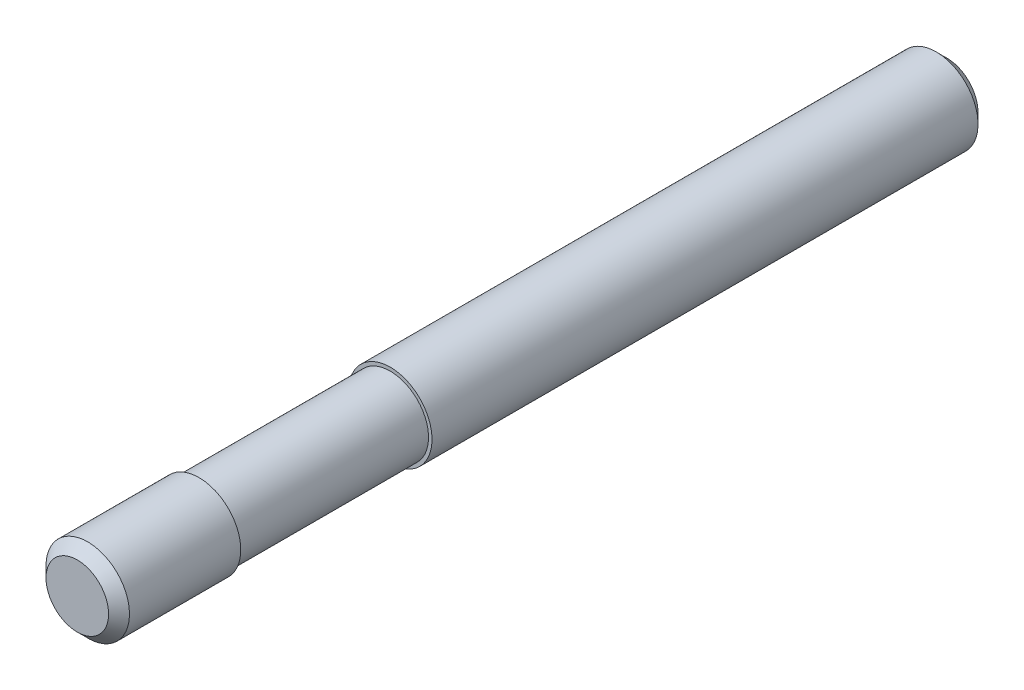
ISO-10303-21;
HEADER;
FILE_DESCRIPTION(('STEP AP214'),'2;1');
FILE_NAME('part.step','',(''),(''),'','','');
FILE_SCHEMA(('AUTOMOTIVE_DESIGN { 1 0 10303 214 1 1 1 1 }'));
ENDSEC;
DATA;
#1=APPLICATION_CONTEXT('core data for automotive mechanical design processes');
#2=APPLICATION_PROTOCOL_DEFINITION('international standard','automotive_design',2000,#1);
#3=PRODUCT_CONTEXT('',#1,'mechanical');
#4=PRODUCT('Part','Part','',(#3));
#5=PRODUCT_RELATED_PRODUCT_CATEGORY('part','',(#4));
#6=PRODUCT_DEFINITION_FORMATION('','',#4);
#7=PRODUCT_DEFINITION_CONTEXT('part definition',#1,'design');
#8=PRODUCT_DEFINITION('design','',#6,#7);
#9=PRODUCT_DEFINITION_SHAPE('','',#8);
#10=(LENGTH_UNIT() NAMED_UNIT(*) SI_UNIT(.MILLI.,.METRE.));
#11=(NAMED_UNIT(*) PLANE_ANGLE_UNIT() SI_UNIT($,.RADIAN.));
#12=(NAMED_UNIT(*) SI_UNIT($,.STERADIAN.) SOLID_ANGLE_UNIT());
#13=UNCERTAINTY_MEASURE_WITH_UNIT(LENGTH_MEASURE(1.E-05),#10,'distance_accuracy_value','');
#14=(GEOMETRIC_REPRESENTATION_CONTEXT(3) GLOBAL_UNCERTAINTY_ASSIGNED_CONTEXT((#13)) GLOBAL_UNIT_ASSIGNED_CONTEXT((#10,
#11,#12)) REPRESENTATION_CONTEXT('',''));
#15=CARTESIAN_POINT('',(0.,0.,0.));
#16=DIRECTION('',(0.,0.,1.));
#17=DIRECTION('',(1.,0.,0.));
#18=AXIS2_PLACEMENT_3D('',#15,#16,#17);
#19=CARTESIAN_POINT('',(-9.,0.,0.));
#20=DIRECTION('',(0.,0.,-1.));
#21=DIRECTION('',(-1.,0.,0.));
#22=AXIS2_PLACEMENT_3D('',#19,#20,#21);
#23=PLANE('',#22);
#24=CARTESIAN_POINT('',(0.,0.,0.));
#25=DIRECTION('',(0.,0.,-1.));
#26=DIRECTION('',(-1.,0.,0.));
#27=AXIS2_PLACEMENT_3D('',#24,#25,#26);
#28=CIRCLE('',#27,9.);
#29=CARTESIAN_POINT('',(-9.,0.,0.));
#30=VERTEX_POINT('',#29);
#31=EDGE_CURVE('E8',#30,#30,#28,.T.);
#32=ORIENTED_EDGE('',*,*,#31,.T.);
#33=EDGE_LOOP('',(#32));
#34=FACE_BOUND('',#33,.T.);
#35=ADVANCED_FACE('F12',(#34),#23,.T.);
#36=CARTESIAN_POINT('',(0.,0.,0.));
#37=DIRECTION('',(0.,0.,1.));
#38=DIRECTION('',(1.,0.,0.));
#39=AXIS2_PLACEMENT_3D('',#36,#37,#38);
#40=CONICAL_SURFACE('',#39,9.,0.785398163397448);
#41=CARTESIAN_POINT('',(0.,0.,3.));
#42=DIRECTION('',(0.,0.,-1.));
#43=DIRECTION('',(-1.,0.,0.));
#44=AXIS2_PLACEMENT_3D('',#41,#42,#43);
#45=CIRCLE('',#44,12.);
#46=CARTESIAN_POINT('',(-12.,0.,3.));
#47=VERTEX_POINT('',#46);
#48=EDGE_CURVE('E18',#47,#47,#45,.T.);
#49=ORIENTED_EDGE('',*,*,#48,.T.);
#50=EDGE_LOOP('',(#49));
#51=FACE_BOUND('',#50,.T.);
#52=ORIENTED_EDGE('',*,*,#31,.F.);
#53=EDGE_LOOP('',(#52));
#54=FACE_BOUND('',#53,.T.);
#55=ADVANCED_FACE('F57',(#51,#54),#40,.T.);
#56=CARTESIAN_POINT('',(0.,0.,0.));
#57=DIRECTION('',(0.,0.,-1.));
#58=DIRECTION('',(-1.,0.,0.));
#59=AXIS2_PLACEMENT_3D('',#56,#57,#58);
#60=CYLINDRICAL_SURFACE('',#59,12.);
#61=CARTESIAN_POINT('',(0.,0.,160.));
#62=DIRECTION('',(0.,0.,-1.));
#63=DIRECTION('',(-1.,0.,0.));
#64=AXIS2_PLACEMENT_3D('',#61,#62,#63);
#65=CIRCLE('',#64,12.);
#66=CARTESIAN_POINT('',(-12.,0.,160.));
#67=VERTEX_POINT('',#66);
#68=EDGE_CURVE('E22',#67,#67,#65,.T.);
#69=ORIENTED_EDGE('',*,*,#68,.T.);
#70=EDGE_LOOP('',(#69));
#71=FACE_BOUND('',#70,.T.);
#72=ORIENTED_EDGE('',*,*,#48,.F.);
#73=EDGE_LOOP('',(#72));
#74=FACE_BOUND('',#73,.T.);
#75=ADVANCED_FACE('F61',(#71,#74),#60,.T.);
#76=CARTESIAN_POINT('',(-11.,0.,160.));
#77=DIRECTION('',(0.,0.,1.));
#78=DIRECTION('',(1.,0.,0.));
#79=AXIS2_PLACEMENT_3D('',#76,#77,#78);
#80=PLANE('',#79);
#81=CARTESIAN_POINT('',(0.,0.,160.));
#82=DIRECTION('',(0.,0.,-1.));
#83=DIRECTION('',(-1.,0.,0.));
#84=AXIS2_PLACEMENT_3D('',#81,#82,#83);
#85=CIRCLE('',#84,11.);
#86=CARTESIAN_POINT('',(-11.,0.,160.));
#87=VERTEX_POINT('',#86);
#88=EDGE_CURVE('E26',#87,#87,#85,.T.);
#89=ORIENTED_EDGE('',*,*,#88,.T.);
#90=EDGE_LOOP('',(#89));
#91=FACE_BOUND('',#90,.T.);
#92=ORIENTED_EDGE('',*,*,#68,.F.);
#93=EDGE_LOOP('',(#92));
#94=FACE_BOUND('',#93,.T.);
#95=ADVANCED_FACE('F65',(#91,#94),#80,.T.);
#96=CARTESIAN_POINT('',(0.,0.,0.));
#97=DIRECTION('',(0.,0.,-1.));
#98=DIRECTION('',(-1.,0.,0.));
#99=AXIS2_PLACEMENT_3D('',#96,#97,#98);
#100=CYLINDRICAL_SURFACE('',#99,11.);
#101=CARTESIAN_POINT('',(0.,0.,215.));
#102=DIRECTION('',(0.,0.,-1.));
#103=DIRECTION('',(-1.,0.,0.));
#104=AXIS2_PLACEMENT_3D('',#101,#102,#103);
#105=CIRCLE('',#104,11.);
#106=CARTESIAN_POINT('',(-11.,0.,215.));
#107=VERTEX_POINT('',#106);
#108=EDGE_CURVE('E31',#107,#107,#105,.T.);
#109=ORIENTED_EDGE('',*,*,#108,.T.);
#110=EDGE_LOOP('',(#109));
#111=FACE_BOUND('',#110,.T.);
#112=ORIENTED_EDGE('',*,*,#88,.F.);
#113=EDGE_LOOP('',(#112));
#114=FACE_BOUND('',#113,.T.);
#115=ADVANCED_FACE('F72',(#111,#114),#100,.T.);
#116=CARTESIAN_POINT('',(-12.,0.,215.));
#117=DIRECTION('',(0.,0.,-1.));
#118=DIRECTION('',(-1.,0.,0.));
#119=AXIS2_PLACEMENT_3D('',#116,#117,#118);
#120=PLANE('',#119);
#121=CARTESIAN_POINT('',(0.,0.,215.));
#122=DIRECTION('',(0.,0.,-1.));
#123=DIRECTION('',(-1.,0.,0.));
#124=AXIS2_PLACEMENT_3D('',#121,#122,#123);
#125=CIRCLE('',#124,12.);
#126=CARTESIAN_POINT('',(-12.,0.,215.));
#127=VERTEX_POINT('',#126);
#128=EDGE_CURVE('E34',#127,#127,#125,.T.);
#129=ORIENTED_EDGE('',*,*,#128,.T.);
#130=EDGE_LOOP('',(#129));
#131=FACE_BOUND('',#130,.T.);
#132=ORIENTED_EDGE('',*,*,#108,.F.);
#133=EDGE_LOOP('',(#132));
#134=FACE_BOUND('',#133,.T.);
#135=ADVANCED_FACE('F76',(#131,#134),#120,.T.);
#136=CARTESIAN_POINT('',(0.,0.,0.));
#137=DIRECTION('',(0.,0.,-1.));
#138=DIRECTION('',(-1.,0.,0.));
#139=AXIS2_PLACEMENT_3D('',#136,#137,#138);
#140=CYLINDRICAL_SURFACE('',#139,12.);
#141=CARTESIAN_POINT('',(0.,0.,247.));
#142=DIRECTION('',(0.,0.,-1.));
#143=DIRECTION('',(-1.,0.,0.));
#144=AXIS2_PLACEMENT_3D('',#141,#142,#143);
#145=CIRCLE('',#144,12.);
#146=CARTESIAN_POINT('',(-12.,0.,247.));
#147=VERTEX_POINT('',#146);
#148=EDGE_CURVE('E37',#147,#147,#145,.T.);
#149=ORIENTED_EDGE('',*,*,#148,.T.);
#150=EDGE_LOOP('',(#149));
#151=FACE_BOUND('',#150,.T.);
#152=ORIENTED_EDGE('',*,*,#128,.F.);
#153=EDGE_LOOP('',(#152));
#154=FACE_BOUND('',#153,.T.);
#155=ADVANCED_FACE('F54',(#151,#154),#140,.T.);
#156=CARTESIAN_POINT('',(0.,0.,247.));
#157=DIRECTION('',(0.,0.,-1.));
#158=DIRECTION('',(-1.,0.,0.));
#159=AXIS2_PLACEMENT_3D('',#156,#157,#158);
#160=CONICAL_SURFACE('',#159,12.,0.785398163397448);
#161=CARTESIAN_POINT('',(0.,0.,250.));
#162=DIRECTION('',(0.,0.,-1.));
#163=DIRECTION('',(-1.,0.,0.));
#164=AXIS2_PLACEMENT_3D('',#161,#162,#163);
#165=CIRCLE('',#164,9.);
#166=CARTESIAN_POINT('',(-9.,0.,250.));
#167=VERTEX_POINT('',#166);
#168=EDGE_CURVE('E40',#167,#167,#165,.T.);
#169=ORIENTED_EDGE('',*,*,#168,.T.);
#170=EDGE_LOOP('',(#169));
#171=FACE_BOUND('',#170,.T.);
#172=ORIENTED_EDGE('',*,*,#148,.F.);
#173=EDGE_LOOP('',(#172));
#174=FACE_BOUND('',#173,.T.);
#175=ADVANCED_FACE('F44',(#171,#174),#160,.T.);
#176=CARTESIAN_POINT('',(0.,0.,250.));
#177=DIRECTION('',(0.,0.,1.));
#178=DIRECTION('',(1.,0.,0.));
#179=AXIS2_PLACEMENT_3D('',#176,#177,#178);
#180=PLANE('',#179);
#181=ORIENTED_EDGE('',*,*,#168,.F.);
#182=EDGE_LOOP('',(#181));
#183=FACE_BOUND('',#182,.T.);
#184=ADVANCED_FACE('F47',(#183),#180,.T.);
#185=CLOSED_SHELL('',(#35,#55,#75,#95,#115,#135,#155,#175,#184));
#186=MANIFOLD_SOLID_BREP('B1',#185);
#187=ADVANCED_BREP_SHAPE_REPRESENTATION('',(#18,#186),#14);
#188=SHAPE_DEFINITION_REPRESENTATION(#9,#187);
ENDSEC;
END-ISO-10303-21;
